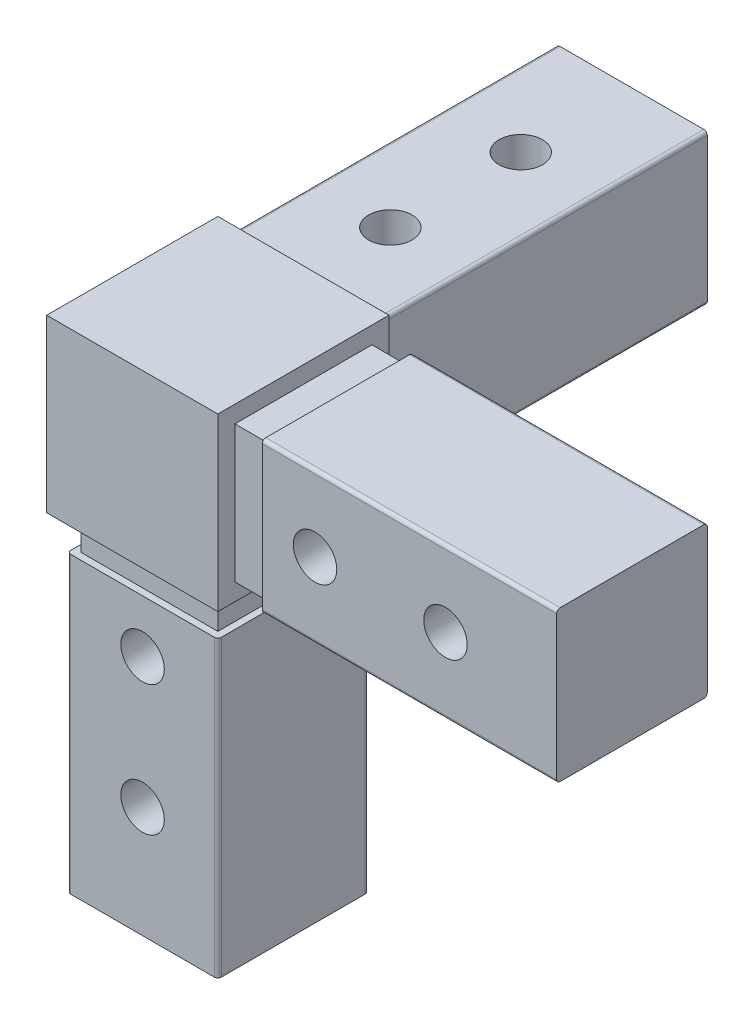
from build123d import *

# Parameters (mm, degrees)
SKETCH1_W            = 22.5
SKETCH1_H            = 22.5
BOSS_EXTRUDE1_DEPTH  = 20
SKETCH2_W            = 20
SKETCH2_H            = 20
BOSS_EXTRUDE2_DEPTH  = 5
SKETCH3_W            = 20
SKETCH3_H            = 20
BOSS_EXTRUDE3_DEPTH  = 5
SKETCH4_W            = 21
SKETCH4_H            = 21
BOSS_EXTRUDE4_DEPTH  = 43
SKETCH5_W            = 22
SKETCH5_H            = 22
BOSS_EXTRUDE5_DEPTH  = 43
SKETCH6_W            = 22.5
SKETCH6_H            = 20
BOSS_EXTRUDE6_DEPTH  = 2.5
SKETCH7_W            = 22.5
SKETCH7_H            = 25
BOSS_EXTRUDE7_DEPTH  = 2.5
SKETCH8_W            = 22.5
SKETCH8_H            = 25
BOSS_EXTRUDE8_DEPTH  = 2.5
SKETCH9_W            = 25
SKETCH9_H            = 25
BOSS_EXTRUDE9_DEPTH  = 2.5
SKETCH10_W           = 43
SKETCH10_H           = 21
BOSS_EXTRUDE10_DEPTH = 1
SKETCH11_W           = 43
SKETCH11_H           = 22
BOSS_EXTRUDE11_DEPTH = 1
SKETCH12_W           = 22
SKETCH12_H           = 22
BOSS_EXTRUDE12_DEPTH = 48
FILLET1_R            = 0.5
SKETCH13_R           = 3.175
CUT_EXTRUDE1_DEPTH   = 22
SKETCH15_R           = 3.175
CUT_EXTRUDE2_DEPTH   = 22
SKETCH17_R           = 3.175
CUT_EXTRUDE4_DEPTH   = 22


with BuildPart() as part:
    # Sketch1 → Boss-Extrude1 (new body)
    with BuildSketch(Plane.XY.offset(10)):
        with Locations((1.25, -1.25)):
            Rectangle(SKETCH1_W, SKETCH1_H)
    extrude(amount=-BOSS_EXTRUDE1_DEPTH)

    # Sketch2 → Boss-Extrude2 (add)
    with BuildSketch(Plane.XZ.offset(12.5)):
        Rectangle(SKETCH2_W, SKETCH2_H)
    extrude(amount=BOSS_EXTRUDE2_DEPTH)

    # Sketch3 → Boss-Extrude3 (add)
    with BuildSketch(Plane(origin=(12.5, 0, 0), x_dir=(0, 0, -1), z_dir=(1, 0, 0))):
        Rectangle(SKETCH3_W, SKETCH3_H)
    extrude(amount=BOSS_EXTRUDE3_DEPTH)

    # Sketch4 → Boss-Extrude4 (add)
    with BuildSketch(Plane(origin=(17.5, 0, 0), x_dir=(0, 0, -1), z_dir=(1, 0, 0))):
        with Locations((0.5, 0.5)):
            Rectangle(SKETCH4_W, SKETCH4_H)
    extrude(amount=BOSS_EXTRUDE4_DEPTH)

    # Sketch5 → Boss-Extrude5 (add)
    with BuildSketch(Plane(origin=(0, -17.5, 0), x_dir=(1, 0, 0), z_dir=(0, 1, 0))):
        Rectangle(SKETCH5_W, SKETCH5_H)
    extrude(amount=-BOSS_EXTRUDE5_DEPTH)

    # Sketch6 → Boss-Extrude6 (add)
    with BuildSketch(Plane(origin=(0, 10, 0), x_dir=(-1, 0, 0), z_dir=(0, 1, 0))):
        with Locations((-1.25, 0)):
            Rectangle(SKETCH6_W, SKETCH6_H)
    extrude(amount=BOSS_EXTRUDE6_DEPTH)

    # Sketch7 → Boss-Extrude7 (add)
    with BuildSketch(Plane.XY.offset(10)):
        with Locations((1.25, 0)):
            Rectangle(SKETCH7_W, SKETCH7_H)
    extrude(amount=BOSS_EXTRUDE7_DEPTH)

    # Sketch8 → Boss-Extrude8 (add)
    with BuildSketch(Plane.ZY.offset(10)):
        with Locations((1.25, 0)):
            Rectangle(SKETCH8_W, SKETCH8_H)
    extrude(amount=BOSS_EXTRUDE8_DEPTH)

    # Sketch9 → Boss-Extrude9 (add)
    with BuildSketch(Plane(origin=(0, 0, -10), x_dir=(-1, 0, 0), z_dir=(0, 0, -1))):
        Rectangle(SKETCH9_W, SKETCH9_H)
    extrude(amount=BOSS_EXTRUDE9_DEPTH)

    # Sketch10 → Boss-Extrude10 (add)
    with BuildSketch(Plane.XZ.offset(10)):
        with Locations((39, -0.5)):
            Rectangle(SKETCH10_W, SKETCH10_H)
    extrude(amount=BOSS_EXTRUDE10_DEPTH)

    # Sketch11 → Boss-Extrude11 (add)
    with BuildSketch(Plane.XY.offset(10)):
        with Locations((39, 0)):
            Rectangle(SKETCH11_W, SKETCH11_H)
    extrude(amount=BOSS_EXTRUDE11_DEPTH)

    # Sketch12 → Boss-Extrude12 (add)
    with BuildSketch(Plane(origin=(0, 0, -12.5), x_dir=(-1, 0, 0), z_dir=(0, 0, -1))):
        Rectangle(SKETCH12_W, SKETCH12_H)
    extrude(amount=BOSS_EXTRUDE12_DEPTH)

    # Fillet1
    fillet1_edges = [part.edges().sort_by_distance(p)[0] for p in [
        (39, -11, -11),
        (39, 11, 11),
        (39, -11, 11),
        (-11, -11, -36.5),
        (-11, 11, -36.5),
        (11, 11, -36.5),
        (11, -11, -36.5),
        (39, 11, -11),
        (-11, -39, -11),
        (11, -39, -11),
        (11, -39, 11),
        (-11, -39, 11),
    ]]
    fillet(fillet1_edges, radius=FILLET1_R)

    # Sketch13 → Cut-Extrude1 (cut)
    with BuildSketch(Plane.XY.offset(11)):
        with Locations((44.25, 0)):
            Circle(SKETCH13_R)
        with Locations((25.2, 0)):
            Circle(SKETCH13_R)
    extrude(amount=-CUT_EXTRUDE1_DEPTH, mode=Mode.SUBTRACT)

    # Sketch15 → Cut-Extrude2 (cut)
    with BuildSketch(Plane.XY.offset(11)):
        with Locations((0, -44.25)):
            Circle(SKETCH15_R)
        with Locations((0, -25.2)):
            Circle(SKETCH15_R)
    extrude(amount=-CUT_EXTRUDE2_DEPTH, mode=Mode.SUBTRACT)

    # Sketch17 → Cut-Extrude4 (cut)
    with BuildSketch(Plane(origin=(0, 11, 0), x_dir=(1, 0, 0), z_dir=(0, 1, 0))):
        with Locations(Location((0, 44.25, 0), (0, 0, 270))):
            Circle(SKETCH17_R)
        with Locations(Location((0, 25.2, 0), (0, 0, 270))):
            Circle(SKETCH17_R)
    extrude(amount=-CUT_EXTRUDE4_DEPTH, mode=Mode.SUBTRACT)


solid = part.part
